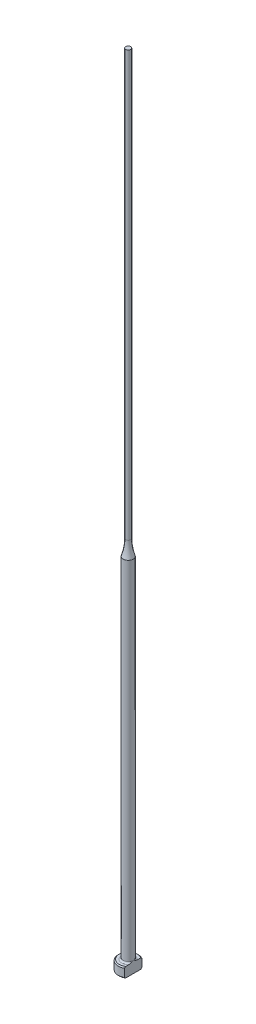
ISO-10303-21;
HEADER;
FILE_DESCRIPTION(('STEP AP214'),'2;1');
FILE_NAME('part.step','',(''),(''),'','','');
FILE_SCHEMA(('AUTOMOTIVE_DESIGN { 1 0 10303 214 1 1 1 1 }'));
ENDSEC;
DATA;
#1=APPLICATION_CONTEXT('core data for automotive mechanical design processes');
#2=APPLICATION_PROTOCOL_DEFINITION('international standard','automotive_design',2000,#1);
#3=PRODUCT_CONTEXT('',#1,'mechanical');
#4=PRODUCT('Part','Part','',(#3));
#5=PRODUCT_RELATED_PRODUCT_CATEGORY('part','',(#4));
#6=PRODUCT_DEFINITION_FORMATION('','',#4);
#7=PRODUCT_DEFINITION_CONTEXT('part definition',#1,'design');
#8=PRODUCT_DEFINITION('design','',#6,#7);
#9=PRODUCT_DEFINITION_SHAPE('','',#8);
#10=(LENGTH_UNIT() NAMED_UNIT(*) SI_UNIT(.MILLI.,.METRE.));
#11=(NAMED_UNIT(*) PLANE_ANGLE_UNIT() SI_UNIT($,.RADIAN.));
#12=(NAMED_UNIT(*) SI_UNIT($,.STERADIAN.) SOLID_ANGLE_UNIT());
#13=UNCERTAINTY_MEASURE_WITH_UNIT(LENGTH_MEASURE(1.E-05),#10,'distance_accuracy_value','');
#14=(GEOMETRIC_REPRESENTATION_CONTEXT(3) GLOBAL_UNCERTAINTY_ASSIGNED_CONTEXT((#13)) GLOBAL_UNIT_ASSIGNED_CONTEXT((#10,
#11,#12)) REPRESENTATION_CONTEXT('',''));
#15=CARTESIAN_POINT('',(0.,0.,0.));
#16=DIRECTION('',(0.,0.,1.));
#17=DIRECTION('',(1.,0.,0.));
#18=AXIS2_PLACEMENT_3D('',#15,#16,#17);
#19=CARTESIAN_POINT('',(-1.99999999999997,2.,0.));
#20=DIRECTION('',(0.,1.,0.));
#21=DIRECTION('',(0.,0.,1.));
#22=AXIS2_PLACEMENT_3D('',#19,#20,#21);
#23=PLANE('',#22);
#24=CARTESIAN_POINT('',(0.,2.,0.));
#25=DIRECTION('',(0.,1.,0.));
#26=DIRECTION('',(0.,0.,1.));
#27=AXIS2_PLACEMENT_3D('',#24,#25,#26);
#28=CIRCLE('',#27,1.79999999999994);
#29=CARTESIAN_POINT('',(0.999999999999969,2.,-1.49666295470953));
#30=VERTEX_POINT('',#29);
#31=CARTESIAN_POINT('',(0.999999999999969,2.,1.49666295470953));
#32=VERTEX_POINT('',#31);
#33=EDGE_CURVE('E187',#30,#32,#28,.T.);
#34=ORIENTED_EDGE('',*,*,#33,.T.);
#35=DIRECTION('',(0.,0.,-1.));
#36=VECTOR('',#35,1.);
#37=CARTESIAN_POINT('',(0.999999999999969,2.,0.));
#38=LINE('',#37,#36);
#39=CARTESIAN_POINT('',(0.999999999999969,2.00000000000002,0.830662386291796));
#40=VERTEX_POINT('',#39);
#41=EDGE_CURVE('E57',#32,#40,#38,.T.);
#42=ORIENTED_EDGE('',*,*,#41,.T.);
#43=CARTESIAN_POINT('',(0.,2.,0.));
#44=DIRECTION('',(0.,1.,0.));
#45=DIRECTION('',(0.,0.,1.));
#46=AXIS2_PLACEMENT_3D('',#43,#44,#45);
#47=CIRCLE('',#46,1.29999999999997);
#48=CARTESIAN_POINT('',(0.999999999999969,2.00000000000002,-0.830662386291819));
#49=VERTEX_POINT('',#48);
#50=EDGE_CURVE('E108',#40,#49,#47,.F.);
#51=ORIENTED_EDGE('',*,*,#50,.T.);
#52=EDGE_CURVE('E137',#49,#30,#38,.T.);
#53=ORIENTED_EDGE('',*,*,#52,.T.);
#54=EDGE_LOOP('',(#34,#42,#51,#53));
#55=FACE_BOUND('',#54,.T.);
#56=ADVANCED_FACE('F32',(#55),#23,.T.);
#57=CARTESIAN_POINT('',(0.,259.958771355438,0.));
#58=DIRECTION('',(0.,1.,0.));
#59=DIRECTION('',(0.,0.,1.));
#60=AXIS2_PLACEMENT_3D('',#57,#58,#59);
#61=CYLINDRICAL_SURFACE('',#60,1.99999999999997);
#62=CARTESIAN_POINT('',(0.,1.79999999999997,0.));
#63=DIRECTION('',(0.,1.,0.));
#64=DIRECTION('',(0.,0.,1.));
#65=AXIS2_PLACEMENT_3D('',#62,#63,#64);
#66=CIRCLE('',#65,1.99999999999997);
#67=CARTESIAN_POINT('',(0.999999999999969,1.79999999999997,1.73205080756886));
#68=VERTEX_POINT('',#67);
#69=CARTESIAN_POINT('',(0.999999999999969,1.79999999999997,-1.73205080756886));
#70=VERTEX_POINT('',#69);
#71=EDGE_CURVE('E105',#68,#70,#66,.F.);
#72=ORIENTED_EDGE('',*,*,#71,.T.);
#73=DIRECTION('',(0.,-1.,0.));
#74=VECTOR('',#73,1.);
#75=CARTESIAN_POINT('',(0.999999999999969,160.,-1.73205080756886));
#76=LINE('',#75,#74);
#77=CARTESIAN_POINT('',(0.999999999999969,0.199999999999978,-1.73205080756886));
#78=VERTEX_POINT('',#77);
#79=EDGE_CURVE('E193',#70,#78,#76,.T.);
#80=ORIENTED_EDGE('',*,*,#79,.T.);
#81=CARTESIAN_POINT('',(0.,0.199999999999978,0.));
#82=DIRECTION('',(0.,-1.,0.));
#83=DIRECTION('',(0.,0.,-1.));
#84=AXIS2_PLACEMENT_3D('',#81,#82,#83);
#85=CIRCLE('',#84,1.99999999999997);
#86=CARTESIAN_POINT('',(0.999999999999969,0.199999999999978,1.73205080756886));
#87=VERTEX_POINT('',#86);
#88=EDGE_CURVE('E100',#78,#87,#85,.F.);
#89=ORIENTED_EDGE('',*,*,#88,.T.);
#90=DIRECTION('',(0.,-1.,0.));
#91=VECTOR('',#90,1.);
#92=CARTESIAN_POINT('',(0.999999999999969,160.,1.73205080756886));
#93=LINE('',#92,#91);
#94=EDGE_CURVE('E93',#68,#87,#93,.T.);
#95=ORIENTED_EDGE('',*,*,#94,.F.);
#96=EDGE_LOOP('',(#72,#80,#89,#95));
#97=FACE_BOUND('',#96,.T.);
#98=ADVANCED_FACE('F158',(#97),#61,.T.);
#99=CARTESIAN_POINT('',(0.,0.,0.));
#100=DIRECTION('',(0.,-1.,0.));
#101=DIRECTION('',(0.,0.,-1.));
#102=AXIS2_PLACEMENT_3D('',#99,#100,#101);
#103=PLANE('',#102);
#104=CARTESIAN_POINT('',(0.,0.,0.));
#105=DIRECTION('',(0.,-1.,0.));
#106=DIRECTION('',(0.,0.,-1.));
#107=AXIS2_PLACEMENT_3D('',#104,#105,#106);
#108=CIRCLE('',#107,1.79999999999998);
#109=CARTESIAN_POINT('',(0.999999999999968,0.,1.49666295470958));
#110=VERTEX_POINT('',#109);
#111=CARTESIAN_POINT('',(0.999999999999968,0.,-1.49666295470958));
#112=VERTEX_POINT('',#111);
#113=EDGE_CURVE('E98',#110,#112,#108,.T.);
#114=ORIENTED_EDGE('',*,*,#113,.T.);
#115=DIRECTION('',(0.,0.,1.));
#116=VECTOR('',#115,1.);
#117=CARTESIAN_POINT('',(0.999999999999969,0.,-1.73205080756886));
#118=LINE('',#117,#116);
#119=EDGE_CURVE('E83',#112,#110,#118,.T.);
#120=ORIENTED_EDGE('',*,*,#119,.T.);
#121=EDGE_LOOP('',(#114,#120));
#122=FACE_BOUND('',#121,.T.);
#123=ADVANCED_FACE('F103',(#122),#103,.T.);
#124=CARTESIAN_POINT('',(0.,2.,0.));
#125=DIRECTION('',(0.,-1.,0.));
#126=DIRECTION('',(0.,0.,-1.));
#127=AXIS2_PLACEMENT_3D('',#124,#125,#126);
#128=CONICAL_SURFACE('',#127,1.79999999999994,0.785398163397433);
#129=ORIENTED_EDGE('',*,*,#71,.F.);
#130=CARTESIAN_POINT('',(0.999999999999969,-0.143084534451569,3.81417299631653));
#131=CARTESIAN_POINT('',(0.999999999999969,-0.0593997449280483,3.72765647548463));
#132=CARTESIAN_POINT('',(0.999999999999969,0.0241940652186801,3.64105173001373));
#133=CARTESIAN_POINT('',(0.999999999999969,0.191148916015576,3.46761616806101));
#134=CARTESIAN_POINT('',(0.999999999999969,0.274509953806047,3.3807853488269));
#135=CARTESIAN_POINT('',(0.999999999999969,0.524249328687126,3.11979400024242));
#136=CARTESIAN_POINT('',(0.999999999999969,0.690198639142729,2.94522254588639));
#137=CARTESIAN_POINT('',(0.999999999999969,1.01697550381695,2.59782670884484));
#138=CARTESIAN_POINT('',(0.999999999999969,1.17783928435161,2.42503661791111));
#139=CARTESIAN_POINT('',(0.999999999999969,1.41669118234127,2.16364984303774));
#140=CARTESIAN_POINT('',(0.999999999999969,1.49589273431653,2.07616357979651));
#141=CARTESIAN_POINT('',(0.999999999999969,1.65313803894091,1.90015721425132));
#142=CARTESIAN_POINT('',(0.999999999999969,1.73118183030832,1.81163714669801));
#143=CARTESIAN_POINT('',(0.999999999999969,1.85567318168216,1.66767927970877));
#144=CARTESIAN_POINT('',(0.999999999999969,1.90265415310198,1.61270332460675));
#145=CARTESIAN_POINT('',(0.999999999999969,1.99577882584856,1.50203557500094));
#146=CARTESIAN_POINT('',(0.999999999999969,2.04192244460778,1.44634371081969));
#147=CARTESIAN_POINT('',(0.999999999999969,2.13356596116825,1.33345480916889));
#148=CARTESIAN_POINT('',(0.999999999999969,2.17905399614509,1.2762481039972));
#149=CARTESIAN_POINT('',(0.999999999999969,2.26844283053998,1.16060976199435));
#150=CARTESIAN_POINT('',(0.999999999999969,2.3123437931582,1.10217825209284));
#151=CARTESIAN_POINT('',(0.999999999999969,2.39853453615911,0.982773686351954));
#152=CARTESIAN_POINT('',(0.999999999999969,2.44078986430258,0.921775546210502));
#153=CARTESIAN_POINT('',(0.999999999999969,2.52187810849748,0.797387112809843));
#154=CARTESIAN_POINT('',(0.999999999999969,2.56070631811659,0.733993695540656));
#155=CARTESIAN_POINT('',(0.999999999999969,2.6324859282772,0.604932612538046));
#156=CARTESIAN_POINT('',(0.999999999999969,2.66550424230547,0.539302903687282));
#157=CARTESIAN_POINT('',(0.999999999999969,2.72301550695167,0.404437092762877));
#158=CARTESIAN_POINT('',(0.999999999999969,2.74753707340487,0.335214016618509));
#159=CARTESIAN_POINT('',(0.999999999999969,2.77407110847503,0.231400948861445));
#160=CARTESIAN_POINT('',(0.999999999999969,2.78110742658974,0.198093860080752));
#161=CARTESIAN_POINT('',(0.999999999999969,2.79200506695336,0.130954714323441));
#162=CARTESIAN_POINT('',(0.999999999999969,2.7958666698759,0.0971227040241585));
#163=CARTESIAN_POINT('',(0.999999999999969,2.80013905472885,0.0293410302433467));
#164=CARTESIAN_POINT('',(0.999999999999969,2.80056046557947,-0.00460794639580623));
#165=CARTESIAN_POINT('',(0.999999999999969,2.79795882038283,-0.0723663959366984));
#166=CARTESIAN_POINT('',(0.999999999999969,2.79493547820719,-0.106175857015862));
#167=CARTESIAN_POINT('',(0.999999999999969,2.78105481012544,-0.206326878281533));
#168=CARTESIAN_POINT('',(0.999999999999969,2.76542146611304,-0.272037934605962));
#169=CARTESIAN_POINT('',(0.999999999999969,2.73477554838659,-0.368312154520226));
#170=CARTESIAN_POINT('',(0.999999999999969,2.72331063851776,-0.40012349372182));
#171=CARTESIAN_POINT('',(0.999999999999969,2.69840546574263,-0.46296441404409));
#172=CARTESIAN_POINT('',(0.999999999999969,2.68496560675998,-0.493994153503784));
#173=CARTESIAN_POINT('',(0.999999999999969,2.64209309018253,-0.586298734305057));
#174=CARTESIAN_POINT('',(0.999999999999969,2.61022871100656,-0.64643570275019));
#175=CARTESIAN_POINT('',(0.999999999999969,2.5422853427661,-0.764304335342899));
#176=CARTESIAN_POINT('',(0.999999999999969,2.50620119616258,-0.822032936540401));
#177=CARTESIAN_POINT('',(0.999999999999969,2.43107084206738,-0.935840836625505));
#178=CARTESIAN_POINT('',(0.999999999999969,2.39201347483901,-0.991912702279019));
#179=CARTESIAN_POINT('',(0.999999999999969,2.31195870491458,-1.10259849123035));
#180=CARTESIAN_POINT('',(0.999999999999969,2.27096226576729,-1.15721311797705));
#181=CARTESIAN_POINT('',(0.999999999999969,2.18701695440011,-1.26606869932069));
#182=CARTESIAN_POINT('',(0.999999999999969,2.14404946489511,-1.32029522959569));
#183=CARTESIAN_POINT('',(0.999999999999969,2.0570505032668,-1.4278898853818));
#184=CARTESIAN_POINT('',(0.999999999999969,2.01301896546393,-1.48125795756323));
#185=CARTESIAN_POINT('',(0.999999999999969,1.87995068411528,-1.64010952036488));
#186=CARTESIAN_POINT('',(0.999999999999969,1.78973357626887,-1.74460261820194));
#187=CARTESIAN_POINT('',(0.999999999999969,1.62290341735,-1.93426834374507));
#188=CARTESIAN_POINT('',(0.999999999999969,1.54658658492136,-2.01970404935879));
#189=CARTESIAN_POINT('',(0.999999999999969,1.39301250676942,-2.18973019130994));
#190=CARTESIAN_POINT('',(0.999999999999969,1.31575523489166,-2.27432060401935));
#191=CARTESIAN_POINT('',(0.999999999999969,1.08283440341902,-2.52732479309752));
#192=CARTESIAN_POINT('',(0.999999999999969,0.926165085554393,-2.69481086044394));
#193=CARTESIAN_POINT('',(0.999999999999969,0.617772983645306,-3.02147252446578));
#194=CARTESIAN_POINT('',(0.999999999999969,0.466111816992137,-3.18070657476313));
#195=CARTESIAN_POINT('',(0.999999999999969,0.238015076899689,-3.41880818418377));
#196=CARTESIAN_POINT('',(0.999999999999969,0.1619245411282,-3.49800657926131));
#197=CARTESIAN_POINT('',(0.999999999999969,0.00955322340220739,-3.65621892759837));
#198=CARTESIAN_POINT('',(0.999999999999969,-0.0667275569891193,-3.73523288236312));
#199=CARTESIAN_POINT('',(0.999999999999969,-0.14308453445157,-3.81417299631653));
#200=B_SPLINE_CURVE_WITH_KNOTS('',3,(#130,#131,#132,#133,#134,#135,#136,#137,#138,#139,#140,
#141,#142,#143,#144,#145,#146,#147,#148,#149,#150,#151,#152,#153,#154,#155,#156,#157,#158,#159,
#160,#161,#162,#163,#164,#165,#166,#167,#168,#169,#170,#171,#172,#173,#174,#175,#176,#177,#178,
#179,#180,#181,#182,#183,#184,#185,#186,#187,#188,#189,#190,#191,#192,#193,#194,#195,#196,#197,
#198,#199),.UNSPECIFIED.,.F.,.F.,(4,2,2,2,2,2,2,2,2,2,2,2,2,2,2,2,2,2,2,2,2,2,2,2,2,2,2,2,2,2,2,
2,2,2,4),(0.,0.36110162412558,0.722207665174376,1.44478731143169,2.15299784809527,
2.5070263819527,2.8610430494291,3.07798416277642,3.29494655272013,3.51418925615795,
3.73340935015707,3.95594813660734,4.17878792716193,4.39886399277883,4.61819150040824,
4.72018864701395,4.82217677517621,4.92384967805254,5.02553102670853,5.22698459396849,
5.32838854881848,5.4297717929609,5.63365200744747,5.837784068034,6.04272417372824,
6.24756349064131,6.45510395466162,6.66265726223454,7.07676259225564,7.42043039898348,
7.76410778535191,8.45210822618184,9.11180822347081,9.44129145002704,9.77077197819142),.UNSPECIFIED.);
#201=EDGE_CURVE('E136',#68,#32,#200,.T.);
#202=ORIENTED_EDGE('',*,*,#201,.T.);
#203=ORIENTED_EDGE('',*,*,#33,.F.);
#204=EDGE_CURVE('E128',#30,#70,#200,.T.);
#205=ORIENTED_EDGE('',*,*,#204,.T.);
#206=EDGE_LOOP('',(#129,#202,#203,#205));
#207=FACE_BOUND('',#206,.T.);
#208=ADVANCED_FACE('F144',(#207),#128,.T.);
#209=CARTESIAN_POINT('',(0.,0.199999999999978,0.));
#210=DIRECTION('',(0.,1.,0.));
#211=DIRECTION('',(0.,0.,1.));
#212=AXIS2_PLACEMENT_3D('',#209,#210,#211);
#213=CONICAL_SURFACE('',#212,1.99999999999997,0.785398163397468);
#214=ORIENTED_EDGE('',*,*,#88,.F.);
#215=CARTESIAN_POINT('',(0.999999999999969,2.14308453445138,-3.81417299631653));
#216=CARTESIAN_POINT('',(0.999999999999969,2.05939974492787,-3.72765647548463));
#217=CARTESIAN_POINT('',(0.999999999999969,1.97580593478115,-3.64105173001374));
#218=CARTESIAN_POINT('',(0.999999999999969,1.80885108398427,-3.46761616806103));
#219=CARTESIAN_POINT('',(0.999999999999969,1.72549004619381,-3.38078534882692));
#220=CARTESIAN_POINT('',(0.999999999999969,1.47575067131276,-3.11979400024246));
#221=CARTESIAN_POINT('',(0.999999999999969,1.30980136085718,-2.94522254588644));
#222=CARTESIAN_POINT('',(0.999999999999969,0.983024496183,-2.5978267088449));
#223=CARTESIAN_POINT('',(0.999999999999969,0.822160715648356,-2.42503661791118));
#224=CARTESIAN_POINT('',(0.999999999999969,0.583308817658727,-2.16364984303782));
#225=CARTESIAN_POINT('',(0.999999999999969,0.50410726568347,-2.0761635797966));
#226=CARTESIAN_POINT('',(0.999999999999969,0.346861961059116,-1.90015721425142));
#227=CARTESIAN_POINT('',(0.999999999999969,0.26881816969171,-1.81163714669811));
#228=CARTESIAN_POINT('',(0.999999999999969,0.144326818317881,-1.66767927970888));
#229=CARTESIAN_POINT('',(0.999999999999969,0.0973458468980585,-1.61270332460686));
#230=CARTESIAN_POINT('',(0.999999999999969,0.00422117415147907,-1.50203557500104));
#231=CARTESIAN_POINT('',(0.999999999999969,-0.0419224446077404,-1.44634371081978));
#232=CARTESIAN_POINT('',(0.999999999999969,-0.133565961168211,-1.33345480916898));
#233=CARTESIAN_POINT('',(0.999999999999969,-0.179053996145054,-1.27624810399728));
#234=CARTESIAN_POINT('',(0.999999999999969,-0.268442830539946,-1.16060976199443));
#235=CARTESIAN_POINT('',(0.999999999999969,-0.31234379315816,-1.10217825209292));
#236=CARTESIAN_POINT('',(0.999999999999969,-0.398534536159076,-0.982773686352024));
#237=CARTESIAN_POINT('',(0.999999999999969,-0.440789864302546,-0.92177554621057));
#238=CARTESIAN_POINT('',(0.999999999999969,-0.521878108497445,-0.797387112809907));
#239=CARTESIAN_POINT('',(0.999999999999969,-0.560706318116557,-0.733993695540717));
#240=CARTESIAN_POINT('',(0.999999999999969,-0.632485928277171,-0.604932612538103));
#241=CARTESIAN_POINT('',(0.999999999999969,-0.665504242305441,-0.539302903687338));
#242=CARTESIAN_POINT('',(0.999999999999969,-0.723015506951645,-0.404437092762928));
#243=CARTESIAN_POINT('',(0.999999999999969,-0.747537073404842,-0.335214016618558));
#244=CARTESIAN_POINT('',(0.999999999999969,-0.774071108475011,-0.231400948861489));
#245=CARTESIAN_POINT('',(0.999999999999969,-0.781107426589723,-0.198093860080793));
#246=CARTESIAN_POINT('',(0.999999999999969,-0.792005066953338,-0.130954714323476));
#247=CARTESIAN_POINT('',(0.999999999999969,-0.795866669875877,-0.0971227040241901));
#248=CARTESIAN_POINT('',(0.999999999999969,-0.800139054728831,-0.0293410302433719));
#249=CARTESIAN_POINT('',(0.999999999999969,-0.80056046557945,0.00460794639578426));
#250=CARTESIAN_POINT('',(0.999999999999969,-0.797958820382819,0.0723663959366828));
#251=CARTESIAN_POINT('',(0.999999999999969,-0.794935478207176,0.106175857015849));
#252=CARTESIAN_POINT('',(0.999999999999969,-0.781054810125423,0.20632687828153));
#253=CARTESIAN_POINT('',(0.999999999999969,-0.765421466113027,0.272037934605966));
#254=CARTESIAN_POINT('',(0.999999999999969,-0.734775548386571,0.36831215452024));
#255=CARTESIAN_POINT('',(0.999999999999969,-0.723310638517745,0.400123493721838));
#256=CARTESIAN_POINT('',(0.999999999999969,-0.698405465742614,0.462964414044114));
#257=CARTESIAN_POINT('',(0.999999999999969,-0.684965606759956,0.493994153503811));
#258=CARTESIAN_POINT('',(0.999999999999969,-0.642093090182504,0.586298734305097));
#259=CARTESIAN_POINT('',(0.999999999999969,-0.610228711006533,0.646435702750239));
#260=CARTESIAN_POINT('',(0.999999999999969,-0.542285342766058,0.764304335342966));
#261=CARTESIAN_POINT('',(0.999999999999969,-0.506201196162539,0.822032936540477));
#262=CARTESIAN_POINT('',(0.999999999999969,-0.431070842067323,0.935840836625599));
#263=CARTESIAN_POINT('',(0.999999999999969,-0.392013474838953,0.991912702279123));
#264=CARTESIAN_POINT('',(0.999999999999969,-0.311958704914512,1.10259849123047));
#265=CARTESIAN_POINT('',(0.999999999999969,-0.270962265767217,1.15721311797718));
#266=CARTESIAN_POINT('',(0.999999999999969,-0.187016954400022,1.26606869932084));
#267=CARTESIAN_POINT('',(0.999999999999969,-0.144049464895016,1.32029522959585));
#268=CARTESIAN_POINT('',(0.999999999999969,-0.0570505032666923,1.42788988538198));
#269=CARTESIAN_POINT('',(0.999999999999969,-0.0130189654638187,1.48125795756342));
#270=CARTESIAN_POINT('',(0.999999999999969,0.120049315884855,1.64010952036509));
#271=CARTESIAN_POINT('',(0.999999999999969,0.21026642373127,1.74460261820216));
#272=CARTESIAN_POINT('',(0.999999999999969,0.37709658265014,1.9342683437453));
#273=CARTESIAN_POINT('',(0.999999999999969,0.453413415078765,2.01970404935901));
#274=CARTESIAN_POINT('',(0.999999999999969,0.606987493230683,2.18973019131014));
#275=CARTESIAN_POINT('',(0.999999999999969,0.684244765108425,2.27432060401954));
#276=CARTESIAN_POINT('',(0.999999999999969,0.917165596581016,2.52732479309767));
#277=CARTESIAN_POINT('',(0.999999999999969,1.07383491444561,2.69481086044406));
#278=CARTESIAN_POINT('',(0.999999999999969,1.38222701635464,3.02147252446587));
#279=CARTESIAN_POINT('',(0.999999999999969,1.53388818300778,3.1807065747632));
#280=CARTESIAN_POINT('',(0.999999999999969,1.76198492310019,3.41880818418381));
#281=CARTESIAN_POINT('',(0.999999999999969,1.83807545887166,3.49800657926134));
#282=CARTESIAN_POINT('',(0.999999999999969,1.99044677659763,3.65621892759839));
#283=CARTESIAN_POINT('',(0.999999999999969,2.06672755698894,3.73523288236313));
#284=CARTESIAN_POINT('',(0.999999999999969,2.14308453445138,3.81417299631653));
#285=B_SPLINE_CURVE_WITH_KNOTS('',3,(#215,#216,#217,#218,#219,#220,#221,#222,#223,#224,#225,
#226,#227,#228,#229,#230,#231,#232,#233,#234,#235,#236,#237,#238,#239,#240,#241,#242,#243,#244,
#245,#246,#247,#248,#249,#250,#251,#252,#253,#254,#255,#256,#257,#258,#259,#260,#261,#262,#263,
#264,#265,#266,#267,#268,#269,#270,#271,#272,#273,#274,#275,#276,#277,#278,#279,#280,#281,#282,
#283,#284),.UNSPECIFIED.,.F.,.F.,(4,2,2,2,2,2,2,2,2,2,2,2,2,2,2,2,2,2,2,2,2,2,2,2,2,2,2,2,2,2,2,
2,2,2,4),(0.,0.36110162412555,0.722207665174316,1.44478731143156,2.15299784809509,
2.5070263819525,2.86104304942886,3.07798416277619,3.2949465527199,3.51418925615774,
3.73340935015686,3.95594813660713,4.17878792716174,4.39886399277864,4.61819150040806,
4.72018864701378,4.82217677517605,4.92384967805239,5.02553102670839,5.22698459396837,
5.32838854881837,5.4297717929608,5.6336520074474,5.83778406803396,6.04272417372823,
6.24756349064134,6.45510395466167,6.66265726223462,7.07676259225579,7.42043039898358,
7.76410778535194,8.45210822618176,9.11180822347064,9.44129145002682,9.77077197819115),.UNSPECIFIED.);
#286=EDGE_CURVE('E86',#78,#112,#285,.T.);
#287=ORIENTED_EDGE('',*,*,#286,.T.);
#288=ORIENTED_EDGE('',*,*,#113,.F.);
#289=EDGE_CURVE('E89',#110,#87,#285,.T.);
#290=ORIENTED_EDGE('',*,*,#289,.T.);
#291=EDGE_LOOP('',(#214,#287,#288,#290));
#292=FACE_BOUND('',#291,.T.);
#293=ADVANCED_FACE('F97',(#292),#213,.T.);
#294=CARTESIAN_POINT('',(0.,2.30000000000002,0.));
#295=DIRECTION('',(0.,1.,0.));
#296=DIRECTION('',(0.,0.,1.));
#297=AXIS2_PLACEMENT_3D('',#294,#295,#296);
#298=TOROIDAL_SURFACE('',#297,1.29999999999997,0.3);
#299=CARTESIAN_POINT('',(0.999999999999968,2.30000000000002,0.));
#300=CARTESIAN_POINT('',(0.999999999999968,2.30000064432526,8.6574445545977E-12));
#301=CARTESIAN_POINT('',(0.999999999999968,2.30000128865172,-9.05742231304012E-08));
#302=CARTESIAN_POINT('',(0.999999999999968,2.30000254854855,-3.98319620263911E-07));
#303=CARTESIAN_POINT('',(0.999999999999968,2.30000316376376,-6.16748313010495E-07));
#304=CARTESIAN_POINT('',(0.999999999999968,2.30000438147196,-1.15047367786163E-06));
#305=CARTESIAN_POINT('',(0.999999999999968,2.30000498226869,-1.46954564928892E-06));
#306=CARTESIAN_POINT('',(0.999999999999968,2.30000613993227,-2.17388585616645E-06));
#307=CARTESIAN_POINT('',(0.999999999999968,2.3000066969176,-2.55896592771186E-06));
#308=CARTESIAN_POINT('',(0.999999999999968,2.30000847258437,-3.89137454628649E-06));
#309=CARTESIAN_POINT('',(0.999999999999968,2.30000962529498,-4.9272569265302E-06));
#310=CARTESIAN_POINT('',(0.999999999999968,2.30001175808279,-7.12255376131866E-06));
#311=CARTESIAN_POINT('',(0.999999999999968,2.30001274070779,-8.27963246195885E-06));
#312=CARTESIAN_POINT('',(0.999999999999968,2.30001619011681,-1.25710396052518E-05));
#313=CARTESIAN_POINT('',(0.999999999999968,2.30001847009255,-1.58589994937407E-05));
#314=CARTESIAN_POINT('',(0.999999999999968,2.3000224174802,-2.25210462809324E-05));
#315=CARTESIAN_POINT('',(0.999999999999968,2.30002411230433,-2.58796667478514E-05));
#316=CARTESIAN_POINT('',(0.999999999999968,2.30003085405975,-3.94941957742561E-05));
#317=CARTESIAN_POINT('',(0.999999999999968,2.30003568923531,-4.98493079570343E-05));
#318=CARTESIAN_POINT('',(0.999999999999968,2.30004388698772,-6.96407730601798E-05));
#319=CARTESIAN_POINT('',(0.999999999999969,2.30004735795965,-7.903098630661E-05));
#320=CARTESIAN_POINT('',(0.999999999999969,2.30007348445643,-0.000144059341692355));
#321=CARTESIAN_POINT('',(0.999999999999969,2.30010510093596,-0.000195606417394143));
#322=CARTESIAN_POINT('',(0.999999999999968,2.30022061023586,-0.000391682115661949));
#323=CARTESIAN_POINT('',(0.999999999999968,2.3002978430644,-0.000539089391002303));
#324=CARTESIAN_POINT('',(0.999999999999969,2.30059433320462,-0.00109591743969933));
#325=CARTESIAN_POINT('',(0.999999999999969,2.30082052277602,-0.00150237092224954));
#326=CARTESIAN_POINT('',(0.999999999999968,2.30171558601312,-0.00311941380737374));
#327=CARTESIAN_POINT('',(0.999999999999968,2.30237677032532,-0.00433326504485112));
#328=CARTESIAN_POINT('',(0.999999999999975,2.31602135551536,-0.0293725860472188));
#329=CARTESIAN_POINT('',(0.99999999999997,2.32909104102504,-0.0531623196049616));
#330=CARTESIAN_POINT('',(0.999999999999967,2.35458080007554,-0.100088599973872));
#331=CARTESIAN_POINT('',(0.999999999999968,2.36700820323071,-0.123221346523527));
#332=CARTESIAN_POINT('',(0.999999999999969,2.39281545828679,-0.172044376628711));
#333=CARTESIAN_POINT('',(0.999999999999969,2.4061616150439,-0.197752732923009));
#334=CARTESIAN_POINT('',(0.999999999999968,2.4323541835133,-0.249714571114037));
#335=CARTESIAN_POINT('',(0.999999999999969,2.44519503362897,-0.27597087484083));
#336=CARTESIAN_POINT('',(0.999999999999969,2.46718175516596,-0.322864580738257));
#337=CARTESIAN_POINT('',(0.999999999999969,2.47650292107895,-0.34341923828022));
#338=CARTESIAN_POINT('',(0.999999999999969,2.49448113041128,-0.384761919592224));
#339=CARTESIAN_POINT('',(0.999999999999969,2.50313958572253,-0.405549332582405));
#340=CARTESIAN_POINT('',(0.999999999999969,2.5276434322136,-0.467585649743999));
#341=CARTESIAN_POINT('',(0.999999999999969,2.54239224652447,-0.509286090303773));
#342=CARTESIAN_POINT('',(0.999999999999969,2.56458900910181,-0.58349816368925));
#343=CARTESIAN_POINT('',(0.999999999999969,2.57294045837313,-0.61573699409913));
#344=CARTESIAN_POINT('',(0.999999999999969,2.58691787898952,-0.682155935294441));
#345=CARTESIAN_POINT('',(0.999999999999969,2.5924232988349,-0.716362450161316));
#346=CARTESIAN_POINT('',(0.999999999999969,2.59932200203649,-0.784996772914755));
#347=CARTESIAN_POINT('',(0.999999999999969,2.60074119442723,-0.819421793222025));
#348=CARTESIAN_POINT('',(0.999999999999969,2.59853032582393,-0.88779225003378));
#349=CARTESIAN_POINT('',(0.999999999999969,2.59495737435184,-0.921738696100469));
#350=CARTESIAN_POINT('',(0.999999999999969,2.58381038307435,-0.977927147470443));
#351=CARTESIAN_POINT('',(0.999999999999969,2.57785171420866,-1.00048693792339));
#352=CARTESIAN_POINT('',(0.999999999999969,2.56267132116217,-1.0445512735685));
#353=CARTESIAN_POINT('',(0.999999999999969,2.55344592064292,-1.06605459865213));
#354=CARTESIAN_POINT('',(0.999999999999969,2.53348156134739,-1.10327564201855));
#355=CARTESIAN_POINT('',(0.999999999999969,2.52335553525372,-1.11931996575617));
#356=CARTESIAN_POINT('',(0.999999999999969,2.50063930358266,-1.1495565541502));
#357=CARTESIAN_POINT('',(0.999999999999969,2.48805327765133,-1.16375189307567));
#358=CARTESIAN_POINT('',(0.999999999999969,2.46313284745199,-1.18709127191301));
#359=CARTESIAN_POINT('',(0.999999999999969,2.45121755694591,-1.19668155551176));
#360=CARTESIAN_POINT('',(0.999999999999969,2.4259612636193,-1.21377371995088));
#361=CARTESIAN_POINT('',(0.999999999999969,2.41262072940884,-1.2212762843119));
#362=CARTESIAN_POINT('',(0.999999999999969,2.38471163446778,-1.23381879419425));
#363=CARTESIAN_POINT('',(0.999999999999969,2.3701356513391,-1.23884240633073));
#364=CARTESIAN_POINT('',(0.999999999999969,2.34029120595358,-1.2460136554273));
#365=CARTESIAN_POINT('',(0.999999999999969,2.32502317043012,-1.24816304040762));
#366=CARTESIAN_POINT('',(0.999999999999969,2.29609418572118,-1.24936303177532));
#367=CARTESIAN_POINT('',(0.999999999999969,2.28244572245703,-1.24873511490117));
#368=CARTESIAN_POINT('',(0.999999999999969,2.25546467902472,-1.24513625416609));
#369=CARTESIAN_POINT('',(0.999999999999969,2.2421320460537,-1.24216570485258));
#370=CARTESIAN_POINT('',(0.999999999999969,2.21644742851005,-1.23414136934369));
#371=CARTESIAN_POINT('',(0.999999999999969,2.20408009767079,-1.22913614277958));
#372=CARTESIAN_POINT('',(0.999999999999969,2.18026539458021,-1.2172891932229));
#373=CARTESIAN_POINT('',(0.999999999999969,2.16881815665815,-1.21044720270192));
#374=CARTESIAN_POINT('',(0.999999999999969,2.14602713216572,-1.19450929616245));
#375=CARTESIAN_POINT('',(0.999999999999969,2.1347876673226,-1.18526487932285));
#376=CARTESIAN_POINT('',(0.999999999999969,2.11372805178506,-1.16528066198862));
#377=CARTESIAN_POINT('',(0.999999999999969,2.1039092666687,-1.15453944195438));
#378=CARTESIAN_POINT('',(0.999999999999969,2.08131380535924,-1.12639326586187));
#379=CARTESIAN_POINT('',(0.999999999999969,2.06941227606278,-1.10828305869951));
#380=CARTESIAN_POINT('',(0.999999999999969,2.04871157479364,-1.07041295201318));
#381=CARTESIAN_POINT('',(0.999999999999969,2.03991325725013,-1.05065259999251));
#382=CARTESIAN_POINT('',(0.999999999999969,2.02219264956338,-1.00203188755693));
#383=CARTESIAN_POINT('',(0.999999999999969,2.01461756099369,-0.972682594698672));
#384=CARTESIAN_POINT('',(0.999999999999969,2.00410660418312,-0.912914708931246));
#385=CARTESIAN_POINT('',(0.999999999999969,2.00122174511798,-0.882487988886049));
#386=CARTESIAN_POINT('',(0.999999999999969,1.99886242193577,-0.80318909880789));
#387=CARTESIAN_POINT('',(0.999999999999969,2.0024814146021,-0.754226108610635));
#388=CARTESIAN_POINT('',(0.999999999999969,2.01327071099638,-0.682724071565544));
#389=CARTESIAN_POINT('',(0.999999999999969,2.01762186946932,-0.659663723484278));
#390=CARTESIAN_POINT('',(0.999999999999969,2.02775671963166,-0.613959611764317));
#391=CARTESIAN_POINT('',(0.999999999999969,2.03353398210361,-0.59131445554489));
#392=CARTESIAN_POINT('',(0.999999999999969,2.05232003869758,-0.525222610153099));
#393=CARTESIAN_POINT('',(0.999999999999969,2.0670175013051,-0.482256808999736));
#394=CARTESIAN_POINT('',(0.999999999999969,2.09166172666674,-0.418361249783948));
#395=CARTESIAN_POINT('',(0.999999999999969,2.10040936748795,-0.396945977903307));
#396=CARTESIAN_POINT('',(0.999999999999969,2.11862724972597,-0.354367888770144));
#397=CARTESIAN_POINT('',(0.999999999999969,2.12809902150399,-0.33320572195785));
#398=CARTESIAN_POINT('',(0.999999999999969,2.15054796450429,-0.284809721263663));
#399=CARTESIAN_POINT('',(0.999999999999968,2.16372144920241,-0.257667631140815));
#400=CARTESIAN_POINT('',(0.999999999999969,2.19063957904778,-0.203972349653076));
#401=CARTESIAN_POINT('',(0.999999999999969,2.20437810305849,-0.177416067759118));
#402=CARTESIAN_POINT('',(0.999999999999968,2.23096755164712,-0.127000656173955));
#403=CARTESIAN_POINT('',(0.999999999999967,2.2437812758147,-0.103121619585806));
#404=CARTESIAN_POINT('',(0.99999999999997,2.27007504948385,-0.0546869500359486));
#405=CARTESIAN_POINT('',(0.999999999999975,2.28356304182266,-0.0301354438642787));
#406=CARTESIAN_POINT('',(0.999999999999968,2.29762327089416,-0.00433318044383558));
#407=CARTESIAN_POINT('',(0.999999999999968,2.29828450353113,-0.00311924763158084));
#408=CARTESIAN_POINT('',(0.999999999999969,2.29917957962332,-0.0015021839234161));
#409=CARTESIAN_POINT('',(0.999999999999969,2.2994057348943,-0.0010957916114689));
#410=CARTESIAN_POINT('',(0.999999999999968,2.29970218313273,-0.000539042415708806));
#411=CARTESIAN_POINT('',(0.999999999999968,2.29977940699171,-0.000391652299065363));
#412=CARTESIAN_POINT('',(0.999999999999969,2.29989490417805,-0.000195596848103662));
#413=CARTESIAN_POINT('',(0.999999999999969,2.2999265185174,-0.000144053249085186));
#414=CARTESIAN_POINT('',(0.999999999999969,2.29995264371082,-7.90290824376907E-05));
#415=CARTESIAN_POINT('',(0.999999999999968,2.29995611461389,-6.96391975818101E-05));
#416=CARTESIAN_POINT('',(0.999999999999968,2.29996431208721,-4.98484228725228E-05));
#417=CARTESIAN_POINT('',(0.999999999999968,2.29996914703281,-3.94936645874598E-05));
#418=CARTESIAN_POINT('',(0.999999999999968,2.29997588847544,-2.587953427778E-05));
#419=CARTESIAN_POINT('',(0.999999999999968,2.29997758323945,-2.25209724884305E-05));
#420=CARTESIAN_POINT('',(0.999999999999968,2.29998153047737,-1.58590310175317E-05));
#421=CARTESIAN_POINT('',(0.999999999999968,2.29998381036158,-1.25711163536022E-05));
#422=CARTESIAN_POINT('',(0.999999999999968,2.29998725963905,-8.27974911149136E-06));
#423=CARTESIAN_POINT('',(0.999999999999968,2.29998824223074,-7.122675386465E-06));
#424=CARTESIAN_POINT('',(0.999999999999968,2.29999037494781,-4.92738159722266E-06));
#425=CARTESIAN_POINT('',(0.999999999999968,2.29999152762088,-3.89149712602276E-06));
#426=CARTESIAN_POINT('',(0.999999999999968,2.29999330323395,-2.5590774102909E-06));
#427=CARTESIAN_POINT('',(0.999999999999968,2.29999386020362,-2.17399250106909E-06));
#428=CARTESIAN_POINT('',(0.999999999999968,2.29999501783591,-1.4696398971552E-06));
#429=CARTESIAN_POINT('',(0.999999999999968,2.299995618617,-1.15056035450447E-06));
#430=CARTESIAN_POINT('',(0.999999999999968,2.29999683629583,-6.16816558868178E-07));
#431=CARTESIAN_POINT('',(0.999999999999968,2.29999745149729,-3.98377208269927E-07));
#432=CARTESIAN_POINT('',(0.999999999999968,2.29999871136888,-9.06063088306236E-08));
#433=CARTESIAN_POINT('',(0.999999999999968,2.29999935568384,-8.657323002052E-12));
#434=CARTESIAN_POINT('',(0.999999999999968,2.30000000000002,0.));
#435=B_SPLINE_CURVE_WITH_KNOTS('',3,(#299,#300,#301,#302,#303,#304,#305,#306,#307,#308,#309,
#310,#311,#312,#313,#314,#315,#316,#317,#318,#319,#320,#321,#322,#323,#324,#325,#326,#327,#328,
#329,#330,#331,#332,#333,#334,#335,#336,#337,#338,#339,#340,#341,#342,#343,#344,#345,#346,#347,
#348,#349,#350,#351,#352,#353,#354,#355,#356,#357,#358,#359,#360,#361,#362,#363,#364,#365,#366,
#367,#368,#369,#370,#371,#372,#373,#374,#375,#376,#377,#378,#379,#380,#381,#382,#383,#384,#385,
#386,#387,#388,#389,#390,#391,#392,#393,#394,#395,#396,#397,#398,#399,#400,#401,#402,#403,#404,
#405,#406,#407,#408,#409,#410,#411,#412,#413,#414,#415,#416,#417,#418,#419,#420,#421,#422,#423,
#424,#425,#426,#427,#428,#429,#430,#431,#432,#433,#434),.UNSPECIFIED.,.T.,.F.,(4,2,2,2,2,2,2,2,
2,2,2,2,2,2,2,2,2,2,2,2,2,2,2,2,2,2,2,2,2,2,2,2,2,2,2,2,2,2,2,2,2,2,2,2,2,2,2,2,2,2,2,2,2,2,2,2,
2,2,2,2,2,2,2,2,2,2,2,4),(0.,1.93088000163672E-06,3.88121487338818E-06,5.91576027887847E-06,
7.94459959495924E-06,1.25713540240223E-05,1.71213138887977E-05,2.9075120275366E-05,
4.0350817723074E-05,7.46190414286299E-05,0.000104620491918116,0.00028499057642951,
0.000785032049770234,0.00217951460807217,0.00632720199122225,0.0877445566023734,
0.166524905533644,0.253417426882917,0.341089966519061,0.408787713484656,0.476336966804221,
0.608850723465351,0.708652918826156,0.812393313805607,0.915474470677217,1.01738599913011,
1.08718721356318,1.15706723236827,1.21377727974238,1.27039179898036,1.31609373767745,
1.36178069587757,1.40776478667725,1.4537208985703,1.49450576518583,1.5352837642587,
1.57514089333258,1.61500383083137,1.65849635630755,1.70203041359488,1.76667915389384,
1.83134568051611,1.92177629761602,2.0131839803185,2.15955153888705,2.22993031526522,
2.29999742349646,2.43600819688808,2.50540041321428,2.57494356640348,2.66544006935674,
2.75513178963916,2.83643278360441,2.92045687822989,2.92460484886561,2.92599912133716,
2.926499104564,2.92667946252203,2.92670946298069,2.92674372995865,2.92675500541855,
2.92676695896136,2.92677150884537,2.92677613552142,2.92677816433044,2.92678019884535,
2.92678214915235,2.92678408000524),.UNSPECIFIED.);
#436=CARTESIAN_POINT('',(0.999999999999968,2.30000000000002,0.));
#437=VERTEX_POINT('',#436);
#438=EDGE_CURVE('E11',#49,#437,#435,.T.);
#439=ORIENTED_EDGE('',*,*,#438,.F.);
#440=ORIENTED_EDGE('',*,*,#50,.F.);
#441=CARTESIAN_POINT('',(0.999999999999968,2.30000000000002,0.));
#442=CARTESIAN_POINT('',(0.999999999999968,2.29999935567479,-8.65741696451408E-12));
#443=CARTESIAN_POINT('',(0.999999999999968,2.29999871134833,9.05742231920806E-08));
#444=CARTESIAN_POINT('',(0.999999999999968,2.2999974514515,3.98319620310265E-07));
#445=CARTESIAN_POINT('',(0.999999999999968,2.29999683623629,6.16748313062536E-07));
#446=CARTESIAN_POINT('',(0.999999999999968,2.29999561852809,1.15047367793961E-06));
#447=CARTESIAN_POINT('',(0.999999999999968,2.29999501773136,1.46954564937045E-06));
#448=CARTESIAN_POINT('',(0.999999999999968,2.29999386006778,2.17388585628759E-06));
#449=CARTESIAN_POINT('',(0.999999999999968,2.29999330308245,2.55896592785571E-06));
#450=CARTESIAN_POINT('',(0.999999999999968,2.29999152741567,3.89137454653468E-06));
#451=CARTESIAN_POINT('',(0.999999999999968,2.29999037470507,4.92725692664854E-06));
#452=CARTESIAN_POINT('',(0.999999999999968,2.29998824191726,7.12255376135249E-06));
#453=CARTESIAN_POINT('',(0.999999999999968,2.29998725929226,8.27963246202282E-06));
#454=CARTESIAN_POINT('',(0.999999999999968,2.29998380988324,1.25710396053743E-05));
#455=CARTESIAN_POINT('',(0.999999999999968,2.2999815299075,1.58589994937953E-05));
#456=CARTESIAN_POINT('',(0.999999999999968,2.29997758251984,2.25210462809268E-05));
#457=CARTESIAN_POINT('',(0.999999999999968,2.29997588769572,2.58796667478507E-05));
#458=CARTESIAN_POINT('',(0.999999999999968,2.29996914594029,3.94941957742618E-05));
#459=CARTESIAN_POINT('',(0.999999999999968,2.29996431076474,4.98493079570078E-05));
#460=CARTESIAN_POINT('',(0.999999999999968,2.29995611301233,6.96407730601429E-05));
#461=CARTESIAN_POINT('',(0.999999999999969,2.2999526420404,7.90309863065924E-05));
#462=CARTESIAN_POINT('',(0.999999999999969,2.29992651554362,0.000144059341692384));
#463=CARTESIAN_POINT('',(0.999999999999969,2.29989489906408,0.000195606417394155));
#464=CARTESIAN_POINT('',(0.999999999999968,2.29977938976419,0.000391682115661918));
#465=CARTESIAN_POINT('',(0.999999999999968,2.29970215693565,0.000539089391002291));
#466=CARTESIAN_POINT('',(0.999999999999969,2.29940566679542,0.00109591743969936));
#467=CARTESIAN_POINT('',(0.999999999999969,2.29917947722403,0.00150237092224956));
#468=CARTESIAN_POINT('',(0.999999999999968,2.29828441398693,0.0031194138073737));
#469=CARTESIAN_POINT('',(0.999999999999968,2.29762322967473,0.0043332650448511));
#470=CARTESIAN_POINT('',(0.999999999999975,2.28397864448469,0.0293725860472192));
#471=CARTESIAN_POINT('',(0.99999999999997,2.27090895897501,0.0531623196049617));
#472=CARTESIAN_POINT('',(0.999999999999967,2.24541919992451,0.100088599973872));
#473=CARTESIAN_POINT('',(0.999999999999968,2.23299179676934,0.123221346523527));
#474=CARTESIAN_POINT('',(0.999999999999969,2.20718454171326,0.172044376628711));
#475=CARTESIAN_POINT('',(0.999999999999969,2.19383838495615,0.197752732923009));
#476=CARTESIAN_POINT('',(0.999999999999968,2.16764581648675,0.249714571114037));
#477=CARTESIAN_POINT('',(0.999999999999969,2.15480496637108,0.27597087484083));
#478=CARTESIAN_POINT('',(0.999999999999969,2.13281824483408,0.322864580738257));
#479=CARTESIAN_POINT('',(0.999999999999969,2.1234970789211,0.34341923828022));
#480=CARTESIAN_POINT('',(0.999999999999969,2.10551886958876,0.384761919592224));
#481=CARTESIAN_POINT('',(0.999999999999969,2.09686041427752,0.405549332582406));
#482=CARTESIAN_POINT('',(0.999999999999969,2.07235656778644,0.467585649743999));
#483=CARTESIAN_POINT('',(0.999999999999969,2.05760775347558,0.509286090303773));
#484=CARTESIAN_POINT('',(0.999999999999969,2.03541099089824,0.58349816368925));
#485=CARTESIAN_POINT('',(0.999999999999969,2.02705954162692,0.61573699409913));
#486=CARTESIAN_POINT('',(0.999999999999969,2.01308212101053,0.682155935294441));
#487=CARTESIAN_POINT('',(0.999999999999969,2.00757670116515,0.716362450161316));
#488=CARTESIAN_POINT('',(0.999999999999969,2.00067799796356,0.784996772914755));
#489=CARTESIAN_POINT('',(0.999999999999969,1.99925880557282,0.819421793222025));
#490=CARTESIAN_POINT('',(0.999999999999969,2.00146967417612,0.88779225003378));
#491=CARTESIAN_POINT('',(0.999999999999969,2.00504262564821,0.921738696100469));
#492=CARTESIAN_POINT('',(0.999999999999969,2.0161896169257,0.977927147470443));
#493=CARTESIAN_POINT('',(0.999999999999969,2.02214828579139,1.00048693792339));
#494=CARTESIAN_POINT('',(0.999999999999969,2.03732867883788,1.0445512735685));
#495=CARTESIAN_POINT('',(0.999999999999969,2.04655407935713,1.06605459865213));
#496=CARTESIAN_POINT('',(0.999999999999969,2.06651843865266,1.10327564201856));
#497=CARTESIAN_POINT('',(0.999999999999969,2.07664446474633,1.11931996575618));
#498=CARTESIAN_POINT('',(0.999999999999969,2.09936069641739,1.14955655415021));
#499=CARTESIAN_POINT('',(0.999999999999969,2.11194672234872,1.16375189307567));
#500=CARTESIAN_POINT('',(0.999999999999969,2.13686715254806,1.18709127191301));
#501=CARTESIAN_POINT('',(0.999999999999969,2.14878244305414,1.19668155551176));
#502=CARTESIAN_POINT('',(0.999999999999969,2.17403873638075,1.21377371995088));
#503=CARTESIAN_POINT('',(0.999999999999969,2.18737927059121,1.2212762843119));
#504=CARTESIAN_POINT('',(0.999999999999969,2.21528836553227,1.23381879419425));
#505=CARTESIAN_POINT('',(0.999999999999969,2.22986434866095,1.23884240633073));
#506=CARTESIAN_POINT('',(0.999999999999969,2.25970879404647,1.2460136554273));
#507=CARTESIAN_POINT('',(0.999999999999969,2.27497682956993,1.24816304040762));
#508=CARTESIAN_POINT('',(0.999999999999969,2.30390581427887,1.24936303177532));
#509=CARTESIAN_POINT('',(0.999999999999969,2.31755427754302,1.24873511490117));
#510=CARTESIAN_POINT('',(0.999999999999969,2.34453532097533,1.24513625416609));
#511=CARTESIAN_POINT('',(0.999999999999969,2.35786795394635,1.24216570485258));
#512=CARTESIAN_POINT('',(0.999999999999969,2.38355257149,1.23414136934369));
#513=CARTESIAN_POINT('',(0.999999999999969,2.39591990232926,1.22913614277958));
#514=CARTESIAN_POINT('',(0.999999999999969,2.41973460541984,1.2172891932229));
#515=CARTESIAN_POINT('',(0.999999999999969,2.4311818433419,1.21044720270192));
#516=CARTESIAN_POINT('',(0.999999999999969,2.45397286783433,1.19450929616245));
#517=CARTESIAN_POINT('',(0.999999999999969,2.46521233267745,1.18526487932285));
#518=CARTESIAN_POINT('',(0.999999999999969,2.48627194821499,1.16528066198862));
#519=CARTESIAN_POINT('',(0.999999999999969,2.49609073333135,1.15453944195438));
#520=CARTESIAN_POINT('',(0.999999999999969,2.51868619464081,1.12639326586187));
#521=CARTESIAN_POINT('',(0.999999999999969,2.53058772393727,1.10828305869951));
#522=CARTESIAN_POINT('',(0.999999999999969,2.55128842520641,1.07041295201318));
#523=CARTESIAN_POINT('',(0.999999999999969,2.56008674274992,1.05065259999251));
#524=CARTESIAN_POINT('',(0.999999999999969,2.57780735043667,1.00203188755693));
#525=CARTESIAN_POINT('',(0.999999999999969,2.58538243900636,0.972682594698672));
#526=CARTESIAN_POINT('',(0.999999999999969,2.59589339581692,0.912914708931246));
#527=CARTESIAN_POINT('',(0.999999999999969,2.59877825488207,0.882487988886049));
#528=CARTESIAN_POINT('',(0.999999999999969,2.60113757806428,0.80318909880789));
#529=CARTESIAN_POINT('',(0.999999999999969,2.59751858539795,0.754226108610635));
#530=CARTESIAN_POINT('',(0.999999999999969,2.58672928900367,0.682724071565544));
#531=CARTESIAN_POINT('',(0.999999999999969,2.58237813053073,0.659663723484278));
#532=CARTESIAN_POINT('',(0.999999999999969,2.57224328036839,0.613959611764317));
#533=CARTESIAN_POINT('',(0.999999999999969,2.56646601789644,0.59131445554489));
#534=CARTESIAN_POINT('',(0.999999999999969,2.54767996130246,0.525222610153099));
#535=CARTESIAN_POINT('',(0.999999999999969,2.53298249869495,0.482256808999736));
#536=CARTESIAN_POINT('',(0.999999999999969,2.50833827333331,0.418361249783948));
#537=CARTESIAN_POINT('',(0.999999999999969,2.49959063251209,0.396945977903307));
#538=CARTESIAN_POINT('',(0.999999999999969,2.48137275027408,0.354367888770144));
#539=CARTESIAN_POINT('',(0.999999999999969,2.47190097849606,0.33320572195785));
#540=CARTESIAN_POINT('',(0.999999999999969,2.44945203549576,0.284809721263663));
#541=CARTESIAN_POINT('',(0.999999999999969,2.43627855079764,0.257667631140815));
#542=CARTESIAN_POINT('',(0.999999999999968,2.40936042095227,0.203972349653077));
#543=CARTESIAN_POINT('',(0.999999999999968,2.39562189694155,0.177416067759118));
#544=CARTESIAN_POINT('',(0.999999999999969,2.36903244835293,0.127000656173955));
#545=CARTESIAN_POINT('',(0.999999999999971,2.35621872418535,0.103121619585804));
#546=CARTESIAN_POINT('',(0.999999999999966,2.32992495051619,0.0546869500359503));
#547=CARTESIAN_POINT('',(0.999999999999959,2.31643695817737,0.0301354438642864));
#548=CARTESIAN_POINT('',(0.999999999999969,2.30237672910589,0.0043331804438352));
#549=CARTESIAN_POINT('',(0.99999999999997,2.30171549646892,0.00311924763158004));
#550=CARTESIAN_POINT('',(0.999999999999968,2.30082042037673,0.00150218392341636));
#551=CARTESIAN_POINT('',(0.999999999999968,2.30059426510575,0.00109579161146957));
#552=CARTESIAN_POINT('',(0.999999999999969,2.30029781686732,0.000539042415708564));
#553=CARTESIAN_POINT('',(0.999999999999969,2.30022059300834,0.000391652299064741));
#554=CARTESIAN_POINT('',(0.999999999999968,2.300105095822,0.000195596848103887));
#555=CARTESIAN_POINT('',(0.999999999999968,2.30007348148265,0.000144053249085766));
#556=CARTESIAN_POINT('',(0.999999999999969,2.30004735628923,7.90290824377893E-05));
#557=CARTESIAN_POINT('',(0.999999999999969,2.30004388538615,6.96391975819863E-05));
#558=CARTESIAN_POINT('',(0.999999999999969,2.30003568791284,4.98484228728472E-05));
#559=CARTESIAN_POINT('',(0.999999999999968,2.30003085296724,3.9493664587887E-05));
#560=CARTESIAN_POINT('',(0.999999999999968,2.30002411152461,2.5879534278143E-05));
#561=CARTESIAN_POINT('',(0.999999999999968,2.3000224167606,2.25209724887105E-05));
#562=CARTESIAN_POINT('',(0.999999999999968,2.30001846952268,1.58590310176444E-05));
#563=CARTESIAN_POINT('',(0.999999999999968,2.30001618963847,1.25711163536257E-05));
#564=CARTESIAN_POINT('',(0.999999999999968,2.300012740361,8.27974911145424E-06));
#565=CARTESIAN_POINT('',(0.999999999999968,2.30001175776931,7.12267538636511E-06));
#566=CARTESIAN_POINT('',(0.999999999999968,2.30000962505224,4.92738159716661E-06));
#567=CARTESIAN_POINT('',(0.999999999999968,2.30000847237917,3.89149712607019E-06));
#568=CARTESIAN_POINT('',(0.999999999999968,2.3000066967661,2.55907741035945E-06));
#569=CARTESIAN_POINT('',(0.999999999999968,2.30000613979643,2.17399250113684E-06));
#570=CARTESIAN_POINT('',(0.999999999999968,2.30000498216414,1.46963989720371E-06));
#571=CARTESIAN_POINT('',(0.999999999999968,2.30000438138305,1.15056035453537E-06));
#572=CARTESIAN_POINT('',(0.999999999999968,2.30000316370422,6.16816558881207E-07));
#573=CARTESIAN_POINT('',(0.999999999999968,2.30000254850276,3.98377208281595E-07));
#574=CARTESIAN_POINT('',(0.999999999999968,2.30000128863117,9.06063088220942E-08));
#575=CARTESIAN_POINT('',(0.999999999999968,2.30000064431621,8.65729541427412E-12));
#576=CARTESIAN_POINT('',(0.999999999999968,2.30000000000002,0.));
#577=B_SPLINE_CURVE_WITH_KNOTS('',3,(#441,#442,#443,#444,#445,#446,#447,#448,#449,#450,#451,
#452,#453,#454,#455,#456,#457,#458,#459,#460,#461,#462,#463,#464,#465,#466,#467,#468,#469,#470,
#471,#472,#473,#474,#475,#476,#477,#478,#479,#480,#481,#482,#483,#484,#485,#486,#487,#488,#489,
#490,#491,#492,#493,#494,#495,#496,#497,#498,#499,#500,#501,#502,#503,#504,#505,#506,#507,#508,
#509,#510,#511,#512,#513,#514,#515,#516,#517,#518,#519,#520,#521,#522,#523,#524,#525,#526,#527,
#528,#529,#530,#531,#532,#533,#534,#535,#536,#537,#538,#539,#540,#541,#542,#543,#544,#545,#546,
#547,#548,#549,#550,#551,#552,#553,#554,#555,#556,#557,#558,#559,#560,#561,#562,#563,#564,#565,
#566,#567,#568,#569,#570,#571,#572,#573,#574,#575,#576),.UNSPECIFIED.,.T.,.F.,(4,2,2,2,2,2,2,2,
2,2,2,2,2,2,2,2,2,2,2,2,2,2,2,2,2,2,2,2,2,2,2,2,2,2,2,2,2,2,2,2,2,2,2,2,2,2,2,2,2,2,2,2,2,2,2,2,
2,2,2,2,2,2,2,2,2,2,2,4),(0.,1.93088000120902E-06,3.88121487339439E-06,5.91576027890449E-06,
7.94459959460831E-06,1.2571354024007E-05,1.71213138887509E-05,2.90751202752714E-05,
4.03508177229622E-05,7.46190414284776E-05,0.000104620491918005,0.000284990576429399,
0.000785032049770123,0.00217951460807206,0.00632720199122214,0.0877445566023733,
0.166524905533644,0.253417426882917,0.341089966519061,0.408787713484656,0.476336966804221,
0.608850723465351,0.708652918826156,0.812393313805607,0.915474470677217,1.01738599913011,
1.08718721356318,1.15706723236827,1.21377727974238,1.27039179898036,1.31609373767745,
1.36178069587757,1.40776478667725,1.4537208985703,1.49450576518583,1.5352837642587,
1.57514089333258,1.61500383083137,1.65849635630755,1.70203041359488,1.76667915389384,
1.83134568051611,1.92177629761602,2.0131839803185,2.15955153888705,2.22993031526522,
2.29999742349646,2.43600819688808,2.50540041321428,2.57494356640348,2.66544006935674,
2.75513178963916,2.83643278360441,2.92045687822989,2.92460484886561,2.92599912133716,
2.926499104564,2.92667946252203,2.92670946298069,2.92674372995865,2.92675500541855,
2.92676695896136,2.92677150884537,2.92677613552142,2.92677816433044,2.92678019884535,
2.92678214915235,2.92678408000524),.UNSPECIFIED.);
#578=EDGE_CURVE('E46',#437,#40,#577,.T.);
#579=ORIENTED_EDGE('',*,*,#578,.F.);
#580=CARTESIAN_POINT('',(0.,2.30000000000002,0.));
#581=DIRECTION('',(0.,1.,0.));
#582=DIRECTION('',(0.,0.,1.));
#583=AXIS2_PLACEMENT_3D('',#580,#581,#582);
#584=CIRCLE('',#583,0.999999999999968);
#585=EDGE_CURVE('E104',#437,#437,#584,.T.);
#586=ORIENTED_EDGE('',*,*,#585,.F.);
#587=EDGE_LOOP('',(#439,#440,#579,#586));
#588=FACE_BOUND('',#587,.T.);
#589=ADVANCED_FACE('F34',(#588),#298,.F.);
#590=CARTESIAN_POINT('',(-0.499999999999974,160.,0.));
#591=DIRECTION('',(0.,1.,0.));
#592=DIRECTION('',(0.,0.,1.));
#593=AXIS2_PLACEMENT_3D('',#590,#591,#592);
#594=PLANE('',#593);
#595=CARTESIAN_POINT('',(0.,160.,0.));
#596=DIRECTION('',(0.,1.,0.));
#597=DIRECTION('',(0.,0.,1.));
#598=AXIS2_PLACEMENT_3D('',#595,#596,#597);
#599=CIRCLE('',#598,0.499999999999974);
#600=CARTESIAN_POINT('',(0.,160.,0.499999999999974));
#601=VERTEX_POINT('',#600);
#602=EDGE_CURVE('E186',#601,#601,#599,.T.);
#603=ORIENTED_EDGE('',*,*,#602,.T.);
#604=EDGE_LOOP('',(#603));
#605=FACE_BOUND('',#604,.T.);
#606=ADVANCED_FACE('F149',(#605),#594,.T.);
#607=CARTESIAN_POINT('',(0.,259.958771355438,0.));
#608=DIRECTION('',(0.,1.,0.));
#609=DIRECTION('',(0.,0.,1.));
#610=AXIS2_PLACEMENT_3D('',#607,#608,#609);
#611=CYLINDRICAL_SURFACE('',#610,0.499999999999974);
#612=CARTESIAN_POINT('',(0.,75.,0.));
#613=DIRECTION('',(0.,1.,0.));
#614=DIRECTION('',(0.,0.,1.));
#615=AXIS2_PLACEMENT_3D('',#612,#613,#614);
#616=CIRCLE('',#615,0.499999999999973);
#617=CARTESIAN_POINT('',(0.,75.,0.499999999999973));
#618=VERTEX_POINT('',#617);
#619=EDGE_CURVE('E183',#618,#618,#616,.T.);
#620=ORIENTED_EDGE('',*,*,#619,.T.);
#621=EDGE_LOOP('',(#620));
#622=FACE_BOUND('',#621,.T.);
#623=ORIENTED_EDGE('',*,*,#602,.F.);
#624=EDGE_LOOP('',(#623));
#625=FACE_BOUND('',#624,.T.);
#626=ADVANCED_FACE('F172',(#622,#625),#611,.T.);
#627=CARTESIAN_POINT('',(0.,75.,0.));
#628=DIRECTION('',(0.,1.,0.));
#629=DIRECTION('',(0.,0.,1.));
#630=AXIS2_PLACEMENT_3D('',#627,#628,#629);
#631=TOROIDAL_SURFACE('',#630,10.5,10.);
#632=CARTESIAN_POINT('',(0.,71.8775010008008,0.));
#633=DIRECTION('',(0.,1.,0.));
#634=DIRECTION('',(0.,0.,1.));
#635=AXIS2_PLACEMENT_3D('',#632,#633,#634);
#636=CIRCLE('',#635,0.999999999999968);
#637=CARTESIAN_POINT('',(0.,71.8775010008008,0.999999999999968));
#638=VERTEX_POINT('',#637);
#639=EDGE_CURVE('E101',#638,#638,#636,.T.);
#640=ORIENTED_EDGE('',*,*,#639,.T.);
#641=EDGE_LOOP('',(#640));
#642=FACE_BOUND('',#641,.T.);
#643=ORIENTED_EDGE('',*,*,#619,.F.);
#644=EDGE_LOOP('',(#643));
#645=FACE_BOUND('',#644,.T.);
#646=ADVANCED_FACE('F169',(#642,#645),#631,.F.);
#647=CARTESIAN_POINT('',(0.,259.958771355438,0.));
#648=DIRECTION('',(0.,1.,0.));
#649=DIRECTION('',(0.,0.,1.));
#650=AXIS2_PLACEMENT_3D('',#647,#648,#649);
#651=CYLINDRICAL_SURFACE('',#650,0.999999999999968);
#652=ORIENTED_EDGE('',*,*,#585,.T.);
#653=EDGE_LOOP('',(#652));
#654=FACE_BOUND('',#653,.T.);
#655=ORIENTED_EDGE('',*,*,#639,.F.);
#656=EDGE_LOOP('',(#655));
#657=FACE_BOUND('',#656,.T.);
#658=ADVANCED_FACE('F122',(#654,#657),#651,.T.);
#659=CARTESIAN_POINT('',(0.999999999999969,160.,-1.73205080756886));
#660=DIRECTION('',(1.,0.,0.));
#661=DIRECTION('',(0.,0.,-1.));
#662=AXIS2_PLACEMENT_3D('',#659,#660,#661);
#663=PLANE('',#662);
#664=ORIENTED_EDGE('',*,*,#79,.F.);
#665=ORIENTED_EDGE('',*,*,#204,.F.);
#666=ORIENTED_EDGE('',*,*,#52,.F.);
#667=ORIENTED_EDGE('',*,*,#438,.T.);
#668=ORIENTED_EDGE('',*,*,#578,.T.);
#669=ORIENTED_EDGE('',*,*,#41,.F.);
#670=ORIENTED_EDGE('',*,*,#201,.F.);
#671=ORIENTED_EDGE('',*,*,#94,.T.);
#672=ORIENTED_EDGE('',*,*,#289,.F.);
#673=ORIENTED_EDGE('',*,*,#119,.F.);
#674=ORIENTED_EDGE('',*,*,#286,.F.);
#675=EDGE_LOOP('',(#664,#665,#666,#667,#668,#669,#670,#671,#672,#673,#674));
#676=FACE_BOUND('',#675,.T.);
#677=ADVANCED_FACE('F85',(#676),#663,.T.);
#678=CLOSED_SHELL('',(#56,#98,#123,#208,#293,#589,#606,#626,#646,#658,#677));
#679=MANIFOLD_SOLID_BREP('B2',#678);
#680=ADVANCED_BREP_SHAPE_REPRESENTATION('',(#18,#679),#14);
#681=SHAPE_DEFINITION_REPRESENTATION(#9,#680);
ENDSEC;
END-ISO-10303-21;
